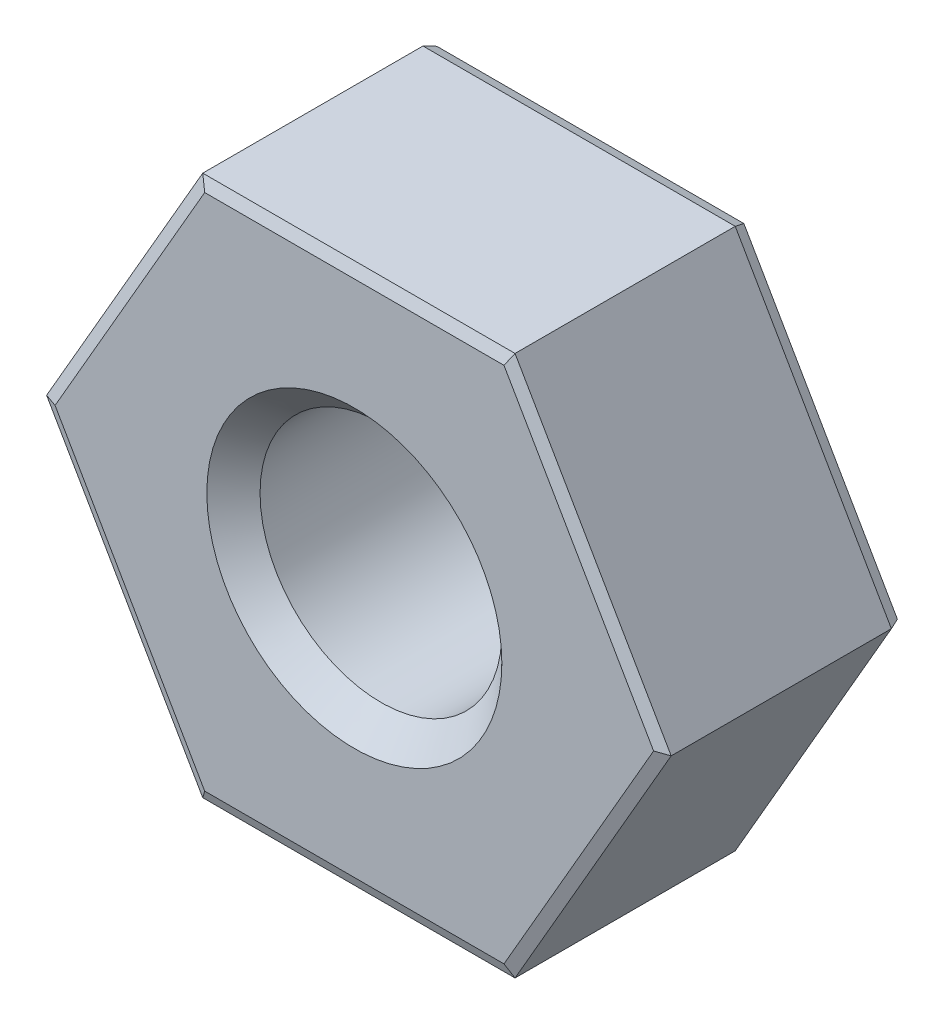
from build123d import *
from OCP.BRepFilletAPI import BRepFilletAPI_MakeChamfer

# Parameters (mm, degrees)
SALIENTE_EXTRUIR1_DEPTH      = 2.4
TALADRO_DE_MARGEN_PARA_M21_D = 2.45875
CHAFL_N1_SIZE                = 0.270625
CHAFL_N2_SIZE                = 0.114592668
CHAFL_N2_SIZE2               = 0.046298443


with BuildPart() as part:
    # Croquis1 → Saliente-Extruir1 (new body)
    with BuildSketch(Plane(origin=(0, 0, 0), x_dir=(-1, 0, 0), z_dir=(0, 0, -1))):
        Polygon((-3.175425, 0), (-1.5877125, -2.749998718), (1.5877125, -2.749998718), (3.175425, 0), (1.5877125, 2.749998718), (-1.5877125, 2.749998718), align=None)
    extrude(amount=-SALIENTE_EXTRUIR1_DEPTH)

    # Taladro de margen para M21 (through all)
    with Locations(Plane.XY.offset(2.4)):
        with Locations((0, 0)):
            Hole(TALADRO_DE_MARGEN_PARA_M21_D / 2)

    # Chafl_n1
    chafl_n1_edges = [part.edges().sort_by_distance(p)[0] for p in [
        (1.229375, 0, 2.4),
        (1.229375, 0, 0),
    ]]
    chamfer(chafl_n1_edges, length=CHAFL_N1_SIZE)

    # Chafl_n2: one chamfer whose edges measure the first distance from different faces: ONE call of the kernel's chamfer builder (chamfer() names one face for all edges)
    chafl_n2_edges_1 = [part.edges().sort_by_distance(p)[0] for p in [
        (0, -2.749998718, 2.4),
        (-2.38156875, -1.374999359, 2.4),
        (-2.38156875, 1.374999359, 2.4),
        (0, 2.749998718, 2.4),
        (2.38156875, 1.374999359, 2.4),
        (2.38156875, -1.374999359, 2.4),
    ]]
    chafl_n2_side_1 = [part.faces().sort_by_distance(p)[0] for p in [
        (1.584013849, 0, 2.4),
    ]]
    chafl_n2_edges_2 = [part.edges().sort_by_distance(p)[0] for p in [
        (0, 2.749998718, 0),
    ]]
    chafl_n2_side_2 = [part.faces().sort_by_distance(p)[0] for p in [
        (0, 2.749998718, 1.2),
    ]]
    chafl_n2_edges_3 = [part.edges().sort_by_distance(p)[0] for p in [
        (-2.38156875, 1.374999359, 0),
    ]]
    chafl_n2_side_3 = [part.faces().sort_by_distance(p)[0] for p in [
        (-2.38156875, 1.374999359, 1.2),
    ]]
    chafl_n2_edges_4 = [part.edges().sort_by_distance(p)[0] for p in [
        (-2.38156875, -1.374999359, 0),
    ]]
    chafl_n2_side_4 = [part.faces().sort_by_distance(p)[0] for p in [
        (-2.38156875, -1.374999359, 1.2),
    ]]
    chafl_n2_edges_5 = [part.edges().sort_by_distance(p)[0] for p in [
        (0, -2.749998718, 0),
    ]]
    chafl_n2_side_5 = [part.faces().sort_by_distance(p)[0] for p in [
        (0, -2.749998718, 1.2),
    ]]
    chafl_n2_edges_6 = [part.edges().sort_by_distance(p)[0] for p in [
        (2.38156875, -1.374999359, 0),
    ]]
    chafl_n2_side_6 = [part.faces().sort_by_distance(p)[0] for p in [
        (2.38156875, -1.374999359, 1.2),
    ]]
    chafl_n2_edges_7 = [part.edges().sort_by_distance(p)[0] for p in [
        (2.38156875, 1.374999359, 0),
    ]]
    chafl_n2_side_7 = [part.faces().sort_by_distance(p)[0] for p in [
        (2.38156875, 1.374999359, 1.2),
    ]]
    chafl_n2 = BRepFilletAPI_MakeChamfer(part.part.solid().wrapped)
    for e in chafl_n2_edges_1:
        chafl_n2.Add(CHAFL_N2_SIZE, CHAFL_N2_SIZE2, e.wrapped, chafl_n2_side_1[0].wrapped)  # the first distance lies on this face
    for e in chafl_n2_edges_2:
        chafl_n2.Add(CHAFL_N2_SIZE, CHAFL_N2_SIZE2, e.wrapped, chafl_n2_side_2[0].wrapped)  # the first distance lies on this face
    for e in chafl_n2_edges_3:
        chafl_n2.Add(CHAFL_N2_SIZE, CHAFL_N2_SIZE2, e.wrapped, chafl_n2_side_3[0].wrapped)  # the first distance lies on this face
    for e in chafl_n2_edges_4:
        chafl_n2.Add(CHAFL_N2_SIZE, CHAFL_N2_SIZE2, e.wrapped, chafl_n2_side_4[0].wrapped)  # the first distance lies on this face
    for e in chafl_n2_edges_5:
        chafl_n2.Add(CHAFL_N2_SIZE, CHAFL_N2_SIZE2, e.wrapped, chafl_n2_side_5[0].wrapped)  # the first distance lies on this face
    for e in chafl_n2_edges_6:
        chafl_n2.Add(CHAFL_N2_SIZE, CHAFL_N2_SIZE2, e.wrapped, chafl_n2_side_6[0].wrapped)  # the first distance lies on this face
    for e in chafl_n2_edges_7:
        chafl_n2.Add(CHAFL_N2_SIZE, CHAFL_N2_SIZE2, e.wrapped, chafl_n2_side_7[0].wrapped)  # the first distance lies on this face
    add(Compound.cast(chafl_n2.Shape()), mode=Mode.REPLACE)


solid = part.part
